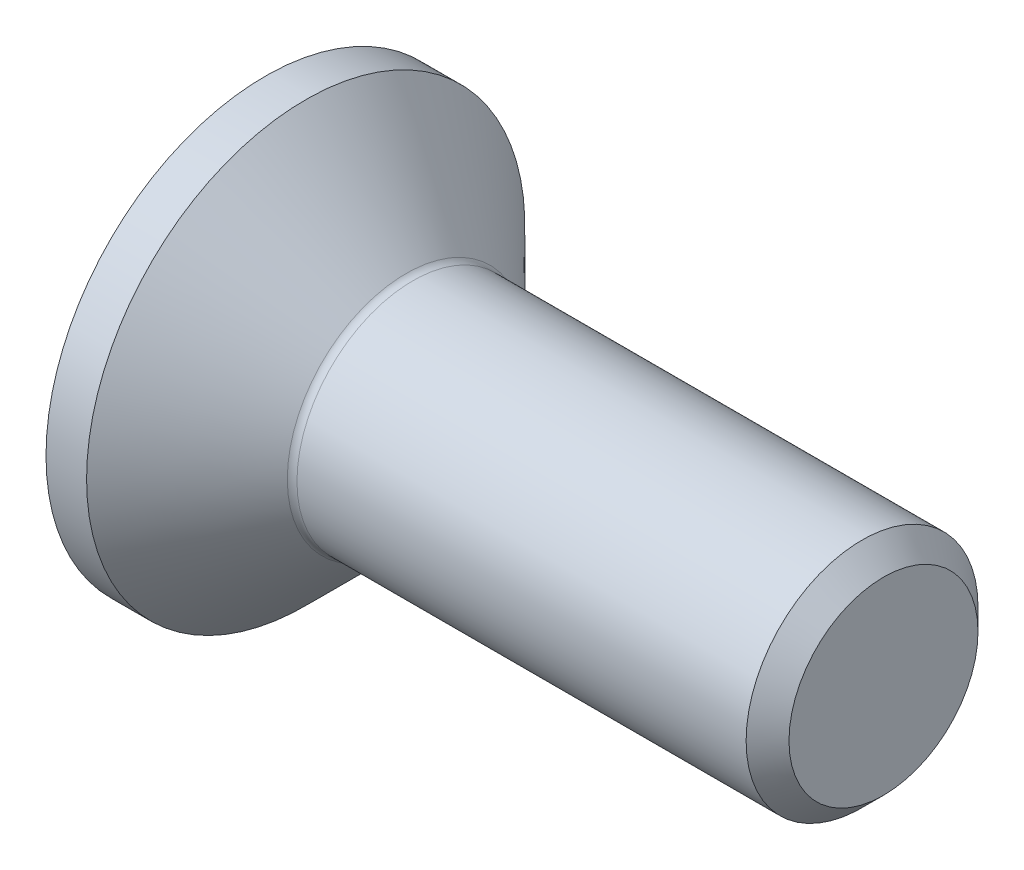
from build123d import *

# Parameters (mm, degrees)
FILLET1_R   = 0.25
HEX_2_DEPTH = 2.2


with BuildPart() as part:
    # BodySke → BaseBody (revolve)
    with BuildSketch(Plane.XY, mode=Mode.PRIVATE) as basebody_sk:
        Polygon((0, 0), (0, 5.67), (1.05, 5.67), (3.72, 3), (15.4455, 3), (16, 2.4455), (16, 0), align=None)
    revolve(basebody_sk.sketch.rotate(Axis((0, 0, 0), (1, 0, 0)), 90), axis=Axis((0, 0, 0), (1, 0, 0)))

    # Fillet1
    fillet1_edges = [part.edges().sort_by_distance(p)[0] for p in [
        (3.72, 0, -3),
    ]]
    fillet(fillet1_edges, radius=FILLET1_R)

    # Sketch2 → PreBroach (revolve, cut)
    with BuildSketch(Plane.XY, mode=Mode.PRIVATE) as prebroach_sk:
        Polygon((0, 2), (2.2, 2), (3.354700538, 0), (0, 0), align=None)
    revolve(prebroach_sk.sketch.rotate(Axis((0, 0, 0), (1, 0, 0)), 90), axis=Axis((0, 0, 0), (1, 0, 0)), mode=Mode.SUBTRACT)

    # Sketch3 → Hex 2 (cut)
    with BuildSketch(Plane.ZY):
        Polygon((-2, -1.154700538), (-2, 1.154700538), (0, 2.309401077), (2, 1.154700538), (2, -1.154700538), (0, -2.309401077), align=None)
    extrude(amount=-HEX_2_DEPTH, mode=Mode.SUBTRACT)


solid = part.part
